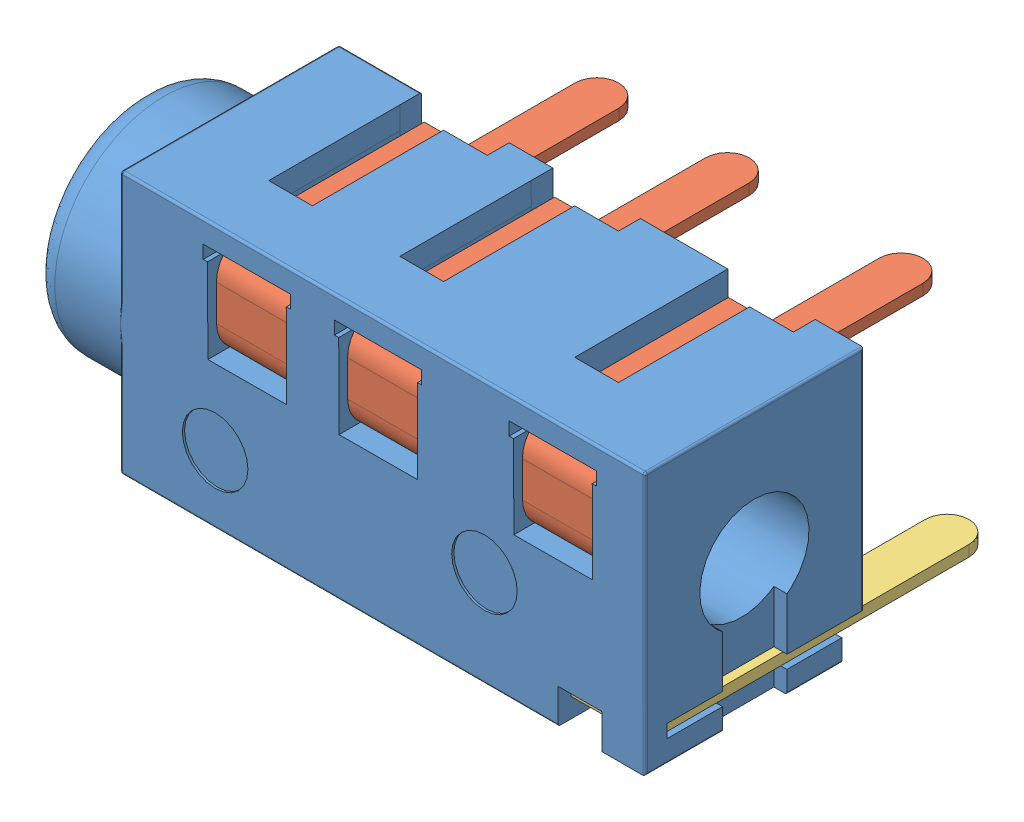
SolidWorks assembly PJ320A.SLDASM, configuration 默认 (file format 11000). Lengths in mm.
Overall size (14 6 8).
5 component instances, 3 part files, 8 mates.
Components (placement in the parent):
- PJ320A-1: PJ320A.SLDPRT [默认] at (0.6927 0.3146 12) size (14 6 6)
- PJ320A-Pin-1: PJ320A-Pin.SLDPRT [默认] at (-1.4086 2.5032 9.986) x (0 0 1) z (0 -1 0) size (7.8 1.95 2.32)
- PJ320A-Pin-3: PJ320A-Pin.SLDPRT [默认] at (1.5746 2.5146 9.986) x (0 0 1) z (0.003937 -0.999992 0) size (7.8 1.95 2.32)
- PJ320A-Pin-6: PJ320A-Pin.SLDPRT [默认] at (5.5478 2.5134 9.986) x (0 0 1) z (0.003937 -0.999992 0) size (7.8 1.95 2.32)
- PJ320A-Pin-B-1: PJ320A-Pin-B.SLDPRT [默认] at (6.5995 -2.1358 12) x (0 0 1) z (0.003937 -0.999992 0) size (7.8 1.8 0.25)
Mates (geometry in assembly coordinates):
- 重合4: coincident: plane of PJ320A-1 through (0.6927 0.3146 12) normal (0 0 -1); plane of PJ320A-Pin-1 through (-2.4086 2.7532 12) normal (0 0 -1)
- 重合11: coincident: plane of PJ320A-1 through (0.6927 0.3146 12) normal (0 0 -1); plane of PJ320A-Pin-3 through (0.5736 2.7607 12) normal (0 0 -1)
- 重合16: coincident: plane of PJ320A-1 through (0.6927 0.3146 12) normal (0 0 -1); plane of PJ320A-Pin-B-1 through (5.5985 -1.8897 12) normal (0 0 -1)
- 重合19: coincident: plane of PJ320A-1 through (0.6927 0.3146 12) normal (0 0 -1); plane of PJ320A-Pin-6 through (4.5468 2.7595 12) normal (0 0 -1)
- 重合20: coincident: plane of PJ320A-1 through (-2.4072 2.5032 15.5) normal (0 1 0); plane of PJ320A-Pin-1 through (-1.4086 2.5032 9.986) normal (0 -1 0)
- 重合21: coincident: plane of PJ320A-1 through (1.584 2.5146 17) normal (-0.003937 0.999992 0); plane of PJ320A-Pin-3 through (1.5746 2.5146 9.986) normal (0.003937 -0.999992 0)
- 重合22: coincident: plane of PJ320A-1 through (5.584 2.5136 17) normal (-0.003937 0.999992 0); plane of PJ320A-Pin-6 through (5.5478 2.5134 9.986) normal (0.003937 -0.999992 0)
- 重合27: coincident: plane of PJ320A-1 through (6.7014 -1.8854 12.5) normal (0.003937 -0.999992 0); plane of PJ320A-Pin-B-1 through (6.5985 -1.8858 12) normal (-0.003937 0.999992 0)
